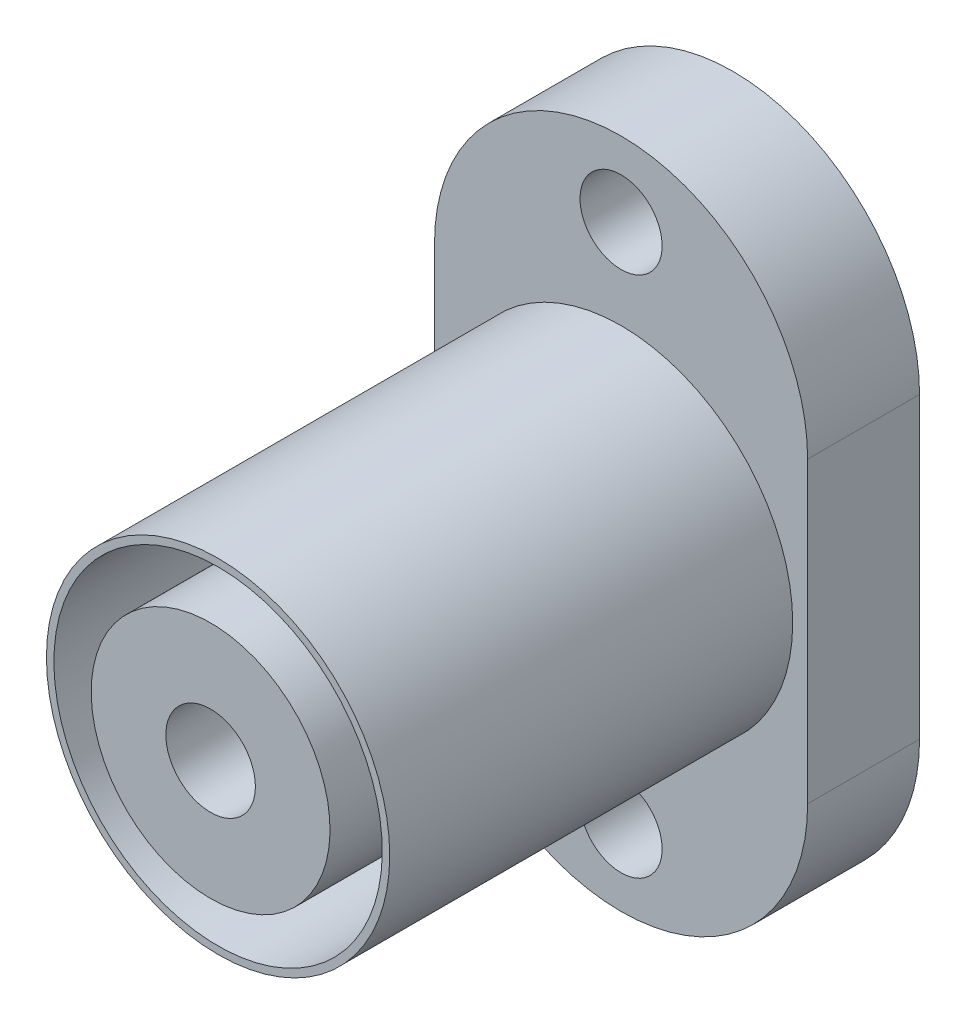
ISO-10303-21;
HEADER;
FILE_DESCRIPTION(('STEP AP214'),'2;1');
FILE_NAME('part.step','',(''),(''),'','','');
FILE_SCHEMA(('AUTOMOTIVE_DESIGN { 1 0 10303 214 1 1 1 1 }'));
ENDSEC;
DATA;
#1=APPLICATION_CONTEXT('core data for automotive mechanical design processes');
#2=APPLICATION_PROTOCOL_DEFINITION('international standard','automotive_design',2000,#1);
#3=PRODUCT_CONTEXT('',#1,'mechanical');
#4=PRODUCT('Part','Part','',(#3));
#5=PRODUCT_RELATED_PRODUCT_CATEGORY('part','',(#4));
#6=PRODUCT_DEFINITION_FORMATION('','',#4);
#7=PRODUCT_DEFINITION_CONTEXT('part definition',#1,'design');
#8=PRODUCT_DEFINITION('design','',#6,#7);
#9=PRODUCT_DEFINITION_SHAPE('','',#8);
#10=(LENGTH_UNIT() NAMED_UNIT(*) SI_UNIT(.MILLI.,.METRE.));
#11=(NAMED_UNIT(*) PLANE_ANGLE_UNIT() SI_UNIT($,.RADIAN.));
#12=(NAMED_UNIT(*) SI_UNIT($,.STERADIAN.) SOLID_ANGLE_UNIT());
#13=UNCERTAINTY_MEASURE_WITH_UNIT(LENGTH_MEASURE(1.E-05),#10,'distance_accuracy_value','');
#14=(GEOMETRIC_REPRESENTATION_CONTEXT(3) GLOBAL_UNCERTAINTY_ASSIGNED_CONTEXT((#13)) GLOBAL_UNIT_ASSIGNED_CONTEXT((#10,
#11,#12)) REPRESENTATION_CONTEXT('',''));
#15=CARTESIAN_POINT('',(0.,0.,0.));
#16=DIRECTION('',(0.,0.,1.));
#17=DIRECTION('',(1.,0.,0.));
#18=AXIS2_PLACEMENT_3D('',#15,#16,#17);
#19=CARTESIAN_POINT('',(-10.626,-10.626,38.));
#20=DIRECTION('',(0.,0.,-1.));
#21=DIRECTION('',(0.,1.,0.));
#22=AXIS2_PLACEMENT_3D('',#19,#20,#21);
#23=PLANE('',#22);
#24=CARTESIAN_POINT('',(0.,0.,38.));
#25=DIRECTION('',(0.,0.,-1.));
#26=DIRECTION('',(-1.,0.,0.));
#27=AXIS2_PLACEMENT_3D('',#24,#25,#26);
#28=CIRCLE('',#27,6.);
#29=CARTESIAN_POINT('',(-6.,0.,38.));
#30=VERTEX_POINT('',#29);
#31=EDGE_CURVE('E122',#30,#30,#28,.T.);
#32=ORIENTED_EDGE('',*,*,#31,.F.);
#33=EDGE_LOOP('',(#32));
#34=FACE_BOUND('',#33,.T.);
#35=CARTESIAN_POINT('',(0.,0.,38.));
#36=DIRECTION('',(0.,0.,-1.));
#37=DIRECTION('',(0.,1.,0.));
#38=AXIS2_PLACEMENT_3D('',#35,#36,#37);
#39=CIRCLE('',#38,10.5);
#40=CARTESIAN_POINT('',(0.,10.5,38.));
#41=VERTEX_POINT('',#40);
#42=EDGE_CURVE('E18',#41,#41,#39,.F.);
#43=ORIENTED_EDGE('',*,*,#42,.F.);
#44=EDGE_LOOP('',(#43));
#45=FACE_BOUND('',#44,.T.);
#46=ADVANCED_FACE('F14',(#34,#45),#23,.T.);
#47=CARTESIAN_POINT('',(0.,0.,38.));
#48=DIRECTION('',(0.,0.,-1.));
#49=DIRECTION('',(0.,1.,0.));
#50=AXIS2_PLACEMENT_3D('',#47,#48,#49);
#51=CYLINDRICAL_SURFACE('',#50,10.5);
#52=ORIENTED_EDGE('',*,*,#42,.T.);
#53=EDGE_LOOP('',(#52));
#54=FACE_BOUND('',#53,.T.);
#55=CARTESIAN_POINT('',(0.,0.,11.));
#56=DIRECTION('',(0.,0.,-1.));
#57=DIRECTION('',(0.,1.,0.));
#58=AXIS2_PLACEMENT_3D('',#55,#56,#57);
#59=CIRCLE('',#58,10.5);
#60=CARTESIAN_POINT('',(0.,10.5,11.));
#61=VERTEX_POINT('',#60);
#62=EDGE_CURVE('E117',#61,#61,#59,.F.);
#63=ORIENTED_EDGE('',*,*,#62,.F.);
#64=EDGE_LOOP('',(#63));
#65=FACE_BOUND('',#64,.T.);
#66=ADVANCED_FACE('F178',(#54,#65),#51,.F.);
#67=CARTESIAN_POINT('',(-13.156,-13.156,11.));
#68=DIRECTION('',(0.,0.,-1.));
#69=DIRECTION('',(0.,1.,0.));
#70=AXIS2_PLACEMENT_3D('',#67,#68,#69);
#71=PLANE('',#70);
#72=ORIENTED_EDGE('',*,*,#62,.T.);
#73=EDGE_LOOP('',(#72));
#74=FACE_BOUND('',#73,.T.);
#75=CARTESIAN_POINT('',(0.,0.,11.));
#76=DIRECTION('',(0.,0.,-1.));
#77=DIRECTION('',(0.,1.,0.));
#78=AXIS2_PLACEMENT_3D('',#75,#76,#77);
#79=CIRCLE('',#78,13.);
#80=CARTESIAN_POINT('',(0.,13.,11.));
#81=VERTEX_POINT('',#80);
#82=EDGE_CURVE('E115',#81,#81,#79,.F.);
#83=ORIENTED_EDGE('',*,*,#82,.F.);
#84=EDGE_LOOP('',(#83));
#85=FACE_BOUND('',#84,.T.);
#86=ADVANCED_FACE('F180',(#74,#85),#71,.T.);
#87=CARTESIAN_POINT('',(-16.192,16.192,70.));
#88=DIRECTION('',(0.,0.,1.));
#89=DIRECTION('',(0.,-1.,0.));
#90=AXIS2_PLACEMENT_3D('',#87,#88,#89);
#91=PLANE('',#90);
#92=CARTESIAN_POINT('',(0.,0.,70.));
#93=DIRECTION('',(0.,0.,1.));
#94=DIRECTION('',(1.,0.,0.));
#95=AXIS2_PLACEMENT_3D('',#92,#93,#94);
#96=CIRCLE('',#95,6.);
#97=CARTESIAN_POINT('',(6.,0.,70.));
#98=VERTEX_POINT('',#97);
#99=EDGE_CURVE('E126',#98,#98,#96,.T.);
#100=ORIENTED_EDGE('',*,*,#99,.F.);
#101=EDGE_LOOP('',(#100));
#102=FACE_BOUND('',#101,.T.);
#103=CARTESIAN_POINT('',(0.,0.,70.));
#104=DIRECTION('',(0.,0.,1.));
#105=DIRECTION('',(0.,-1.,0.));
#106=AXIS2_PLACEMENT_3D('',#103,#104,#105);
#107=CIRCLE('',#106,16.);
#108=CARTESIAN_POINT('',(0.,-16.,70.));
#109=VERTEX_POINT('',#108);
#110=EDGE_CURVE('E112',#109,#109,#107,.T.);
#111=ORIENTED_EDGE('',*,*,#110,.T.);
#112=EDGE_LOOP('',(#111));
#113=FACE_BOUND('',#112,.T.);
#114=ADVANCED_FACE('F183',(#102,#113),#91,.T.);
#115=CARTESIAN_POINT('',(0.,0.,11.));
#116=DIRECTION('',(0.,0.,-1.));
#117=DIRECTION('',(0.,1.,0.));
#118=AXIS2_PLACEMENT_3D('',#115,#116,#117);
#119=CYLINDRICAL_SURFACE('',#118,13.);
#120=ORIENTED_EDGE('',*,*,#82,.T.);
#121=EDGE_LOOP('',(#120));
#122=FACE_BOUND('',#121,.T.);
#123=CARTESIAN_POINT('',(0.,0.,0.));
#124=DIRECTION('',(0.,0.,-1.));
#125=DIRECTION('',(0.,1.,0.));
#126=AXIS2_PLACEMENT_3D('',#123,#124,#125);
#127=CIRCLE('',#126,13.);
#128=CARTESIAN_POINT('',(0.,13.,0.));
#129=VERTEX_POINT('',#128);
#130=EDGE_CURVE('E109',#129,#129,#127,.T.);
#131=ORIENTED_EDGE('',*,*,#130,.T.);
#132=EDGE_LOOP('',(#131));
#133=FACE_BOUND('',#132,.T.);
#134=ADVANCED_FACE('F186',(#122,#133),#119,.F.);
#135=CARTESIAN_POINT('',(0.,0.,20.));
#136=DIRECTION('',(0.,0.,1.));
#137=DIRECTION('',(0.,-1.,0.));
#138=AXIS2_PLACEMENT_3D('',#135,#136,#137);
#139=CYLINDRICAL_SURFACE('',#138,16.);
#140=ORIENTED_EDGE('',*,*,#110,.F.);
#141=EDGE_LOOP('',(#140));
#142=FACE_BOUND('',#141,.T.);
#143=CARTESIAN_POINT('',(0.,0.,20.));
#144=DIRECTION('',(0.,0.,1.));
#145=DIRECTION('',(0.,-1.,0.));
#146=AXIS2_PLACEMENT_3D('',#143,#144,#145);
#147=CIRCLE('',#146,16.);
#148=CARTESIAN_POINT('',(0.,-16.,20.));
#149=VERTEX_POINT('',#148);
#150=EDGE_CURVE('E65',#149,#149,#147,.T.);
#151=ORIENTED_EDGE('',*,*,#150,.T.);
#152=EDGE_LOOP('',(#151));
#153=FACE_BOUND('',#152,.T.);
#154=ADVANCED_FACE('F191',(#142,#153),#139,.T.);
#155=CARTESIAN_POINT('',(-25.,45.54,0.));
#156=DIRECTION('',(0.,0.,1.));
#157=DIRECTION('',(0.,-1.,0.));
#158=AXIS2_PLACEMENT_3D('',#155,#156,#157);
#159=PLANE('',#158);
#160=CARTESIAN_POINT('',(0.,35.,0.));
#161=DIRECTION('',(0.,0.,1.));
#162=DIRECTION('',(0.,-1.,0.));
#163=AXIS2_PLACEMENT_3D('',#160,#161,#162);
#164=CIRCLE('',#163,5.5);
#165=CARTESIAN_POINT('',(0.,29.5,0.));
#166=VERTEX_POINT('',#165);
#167=EDGE_CURVE('E99',#166,#166,#164,.F.);
#168=ORIENTED_EDGE('',*,*,#167,.F.);
#169=EDGE_LOOP('',(#168));
#170=FACE_BOUND('',#169,.T.);
#171=CARTESIAN_POINT('',(0.,-35.,0.));
#172=DIRECTION('',(0.,0.,1.));
#173=DIRECTION('',(0.,-1.,0.));
#174=AXIS2_PLACEMENT_3D('',#171,#172,#173);
#175=CIRCLE('',#174,5.5);
#176=CARTESIAN_POINT('',(0.,-40.5,0.));
#177=VERTEX_POINT('',#176);
#178=EDGE_CURVE('E102',#177,#177,#175,.F.);
#179=ORIENTED_EDGE('',*,*,#178,.F.);
#180=EDGE_LOOP('',(#179));
#181=FACE_BOUND('',#180,.T.);
#182=ORIENTED_EDGE('',*,*,#130,.F.);
#183=EDGE_LOOP('',(#182));
#184=FACE_BOUND('',#183,.T.);
#185=DIRECTION('',(0.,1.,0.));
#186=VECTOR('',#185,1.);
#187=CARTESIAN_POINT('',(25.,1.49999977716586E-09,0.));
#188=LINE('',#187,#186);
#189=CARTESIAN_POINT('',(25.,-19.9999999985,0.));
#190=VERTEX_POINT('',#189);
#191=CARTESIAN_POINT('',(25.,20.,0.));
#192=VERTEX_POINT('',#191);
#193=EDGE_CURVE('E61',#190,#192,#188,.T.);
#194=ORIENTED_EDGE('',*,*,#193,.F.);
#195=CARTESIAN_POINT('',(0.,-20.,0.));
#196=DIRECTION('',(0.,0.,1.));
#197=DIRECTION('',(0.,-1.,0.));
#198=AXIS2_PLACEMENT_3D('',#195,#196,#197);
#199=CIRCLE('',#198,25.);
#200=CARTESIAN_POINT('',(-25.,-19.9999999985,0.));
#201=VERTEX_POINT('',#200);
#202=EDGE_CURVE('E54',#190,#201,#199,.F.);
#203=ORIENTED_EDGE('',*,*,#202,.T.);
#204=DIRECTION('',(0.,-1.,0.));
#205=VECTOR('',#204,1.);
#206=CARTESIAN_POINT('',(-25.,3.99999998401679E-09,0.));
#207=LINE('',#206,#205);
#208=CARTESIAN_POINT('',(-25.,20.0000000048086,0.));
#209=VERTEX_POINT('',#208);
#210=EDGE_CURVE('E58',#209,#201,#207,.T.);
#211=ORIENTED_EDGE('',*,*,#210,.F.);
#212=CARTESIAN_POINT('',(0.,20.,0.));
#213=DIRECTION('',(0.,0.,1.));
#214=DIRECTION('',(0.,-1.,0.));
#215=AXIS2_PLACEMENT_3D('',#212,#213,#214);
#216=CIRCLE('',#215,25.);
#217=EDGE_CURVE('E73',#209,#192,#216,.F.);
#218=ORIENTED_EDGE('',*,*,#217,.T.);
#219=EDGE_LOOP('',(#194,#203,#211,#218));
#220=FACE_BOUND('',#219,.T.);
#221=ADVANCED_FACE('F56',(#170,#181,#184,#220),#159,.F.);
#222=CARTESIAN_POINT('',(-22.264,-22.264,20.));
#223=DIRECTION('',(0.,0.,-1.));
#224=DIRECTION('',(0.,1.,0.));
#225=AXIS2_PLACEMENT_3D('',#222,#223,#224);
#226=PLANE('',#225);
#227=ORIENTED_EDGE('',*,*,#150,.F.);
#228=EDGE_LOOP('',(#227));
#229=FACE_BOUND('',#228,.T.);
#230=CARTESIAN_POINT('',(0.,0.,20.));
#231=DIRECTION('',(0.,0.,-1.));
#232=DIRECTION('',(0.,1.,0.));
#233=AXIS2_PLACEMENT_3D('',#230,#231,#232);
#234=CIRCLE('',#233,22.);
#235=CARTESIAN_POINT('',(0.,22.,20.));
#236=VERTEX_POINT('',#235);
#237=EDGE_CURVE('E96',#236,#236,#234,.T.);
#238=ORIENTED_EDGE('',*,*,#237,.F.);
#239=EDGE_LOOP('',(#238));
#240=FACE_BOUND('',#239,.T.);
#241=ADVANCED_FACE('F190',(#229,#240),#226,.F.);
#242=CARTESIAN_POINT('',(0.,-20.,0.));
#243=DIRECTION('',(0.,0.,1.));
#244=DIRECTION('',(0.,-1.,0.));
#245=AXIS2_PLACEMENT_3D('',#242,#243,#244);
#246=CYLINDRICAL_SURFACE('',#245,25.);
#247=ORIENTED_EDGE('',*,*,#202,.F.);
#248=DIRECTION('',(0.,0.,-1.));
#249=VECTOR('',#248,1.);
#250=CARTESIAN_POINT('',(25.,-19.999999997,7.5));
#251=LINE('',#250,#249);
#252=CARTESIAN_POINT('',(25.,-19.9999999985,15.));
#253=VERTEX_POINT('',#252);
#254=EDGE_CURVE('E137',#253,#190,#251,.T.);
#255=ORIENTED_EDGE('',*,*,#254,.F.);
#256=CARTESIAN_POINT('',(0.,-20.,15.));
#257=DIRECTION('',(0.,0.,1.));
#258=DIRECTION('',(0.,-1.,0.));
#259=AXIS2_PLACEMENT_3D('',#256,#257,#258);
#260=CIRCLE('',#259,25.);
#261=CARTESIAN_POINT('',(-25.,-19.9999999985,15.));
#262=VERTEX_POINT('',#261);
#263=EDGE_CURVE('E70',#253,#262,#260,.F.);
#264=ORIENTED_EDGE('',*,*,#263,.T.);
#265=DIRECTION('',(0.,0.,1.));
#266=VECTOR('',#265,1.);
#267=CARTESIAN_POINT('',(-25.,-19.999999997,7.5));
#268=LINE('',#267,#266);
#269=EDGE_CURVE('E68',#201,#262,#268,.T.);
#270=ORIENTED_EDGE('',*,*,#269,.F.);
#271=EDGE_LOOP('',(#247,#255,#264,#270));
#272=FACE_BOUND('',#271,.T.);
#273=ADVANCED_FACE('F69',(#272),#246,.T.);
#274=CARTESIAN_POINT('',(-25.,20.000000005,0.));
#275=DIRECTION('',(-1.,0.,0.));
#276=DIRECTION('',(0.,-1.,0.));
#277=AXIS2_PLACEMENT_3D('',#274,#275,#276);
#278=PLANE('',#277);
#279=ORIENTED_EDGE('',*,*,#210,.T.);
#280=ORIENTED_EDGE('',*,*,#269,.T.);
#281=DIRECTION('',(0.,1.,0.));
#282=VECTOR('',#281,1.);
#283=CARTESIAN_POINT('',(-25.,0.,15.));
#284=LINE('',#283,#282);
#285=CARTESIAN_POINT('',(-25.,20.0000000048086,15.));
#286=VERTEX_POINT('',#285);
#287=EDGE_CURVE('E94',#262,#286,#284,.T.);
#288=ORIENTED_EDGE('',*,*,#287,.T.);
#289=DIRECTION('',(0.,0.,1.));
#290=VECTOR('',#289,1.);
#291=CARTESIAN_POINT('',(-25.,20.0000000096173,7.5));
#292=LINE('',#291,#290);
#293=EDGE_CURVE('E76',#286,#209,#292,.F.);
#294=ORIENTED_EDGE('',*,*,#293,.T.);
#295=EDGE_LOOP('',(#279,#280,#288,#294));
#296=FACE_BOUND('',#295,.T.);
#297=ADVANCED_FACE('F75',(#296),#278,.T.);
#298=CARTESIAN_POINT('',(0.,20.,0.));
#299=DIRECTION('',(0.,0.,1.));
#300=DIRECTION('',(0.,-1.,0.));
#301=AXIS2_PLACEMENT_3D('',#298,#299,#300);
#302=CYLINDRICAL_SURFACE('',#301,25.);
#303=CARTESIAN_POINT('',(0.,20.,15.));
#304=DIRECTION('',(0.,0.,1.));
#305=DIRECTION('',(0.,-1.,0.));
#306=AXIS2_PLACEMENT_3D('',#303,#304,#305);
#307=CIRCLE('',#306,25.);
#308=CARTESIAN_POINT('',(25.,20.,15.));
#309=VERTEX_POINT('',#308);
#310=EDGE_CURVE('E33',#286,#309,#307,.F.);
#311=ORIENTED_EDGE('',*,*,#310,.T.);
#312=DIRECTION('',(0.,0.,1.));
#313=VECTOR('',#312,1.);
#314=CARTESIAN_POINT('',(25.,20.,7.5));
#315=LINE('',#314,#313);
#316=EDGE_CURVE('E105',#192,#309,#315,.T.);
#317=ORIENTED_EDGE('',*,*,#316,.F.);
#318=ORIENTED_EDGE('',*,*,#217,.F.);
#319=ORIENTED_EDGE('',*,*,#293,.F.);
#320=EDGE_LOOP('',(#311,#317,#318,#319));
#321=FACE_BOUND('',#320,.T.);
#322=ADVANCED_FACE('F144',(#321),#302,.T.);
#323=CARTESIAN_POINT('',(25.,-19.999999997,0.));
#324=DIRECTION('',(1.,0.,0.));
#325=DIRECTION('',(0.,1.,0.));
#326=AXIS2_PLACEMENT_3D('',#323,#324,#325);
#327=PLANE('',#326);
#328=ORIENTED_EDGE('',*,*,#193,.T.);
#329=ORIENTED_EDGE('',*,*,#316,.T.);
#330=DIRECTION('',(0.,-1.,0.));
#331=VECTOR('',#330,1.);
#332=CARTESIAN_POINT('',(25.,0.,15.));
#333=LINE('',#332,#331);
#334=EDGE_CURVE('E92',#309,#253,#333,.T.);
#335=ORIENTED_EDGE('',*,*,#334,.T.);
#336=ORIENTED_EDGE('',*,*,#254,.T.);
#337=EDGE_LOOP('',(#328,#329,#335,#336));
#338=FACE_BOUND('',#337,.T.);
#339=ADVANCED_FACE('F140',(#338),#327,.T.);
#340=CARTESIAN_POINT('',(0.,-35.,0.));
#341=DIRECTION('',(0.,0.,1.));
#342=DIRECTION('',(0.,-1.,0.));
#343=AXIS2_PLACEMENT_3D('',#340,#341,#342);
#344=CYLINDRICAL_SURFACE('',#343,5.5);
#345=ORIENTED_EDGE('',*,*,#178,.T.);
#346=EDGE_LOOP('',(#345));
#347=FACE_BOUND('',#346,.T.);
#348=CARTESIAN_POINT('',(0.,-35.,15.));
#349=DIRECTION('',(0.,0.,1.));
#350=DIRECTION('',(0.,-1.,0.));
#351=AXIS2_PLACEMENT_3D('',#348,#349,#350);
#352=CIRCLE('',#351,5.5);
#353=CARTESIAN_POINT('',(0.,-40.5,15.));
#354=VERTEX_POINT('',#353);
#355=EDGE_CURVE('E89',#354,#354,#352,.T.);
#356=ORIENTED_EDGE('',*,*,#355,.T.);
#357=EDGE_LOOP('',(#356));
#358=FACE_BOUND('',#357,.T.);
#359=ADVANCED_FACE('F153',(#347,#358),#344,.F.);
#360=CARTESIAN_POINT('',(0.,35.,0.));
#361=DIRECTION('',(0.,0.,1.));
#362=DIRECTION('',(0.,-1.,0.));
#363=AXIS2_PLACEMENT_3D('',#360,#361,#362);
#364=CYLINDRICAL_SURFACE('',#363,5.5);
#365=ORIENTED_EDGE('',*,*,#167,.T.);
#366=EDGE_LOOP('',(#365));
#367=FACE_BOUND('',#366,.T.);
#368=CARTESIAN_POINT('',(0.,35.,15.));
#369=DIRECTION('',(0.,0.,1.));
#370=DIRECTION('',(0.,-1.,0.));
#371=AXIS2_PLACEMENT_3D('',#368,#369,#370);
#372=CIRCLE('',#371,5.5);
#373=CARTESIAN_POINT('',(0.,29.5,15.));
#374=VERTEX_POINT('',#373);
#375=EDGE_CURVE('E86',#374,#374,#372,.T.);
#376=ORIENTED_EDGE('',*,*,#375,.T.);
#377=EDGE_LOOP('',(#376));
#378=FACE_BOUND('',#377,.T.);
#379=ADVANCED_FACE('F201',(#367,#378),#364,.F.);
#380=CARTESIAN_POINT('',(0.,0.,69.));
#381=DIRECTION('',(0.,0.,-1.));
#382=DIRECTION('',(0.,1.,0.));
#383=AXIS2_PLACEMENT_3D('',#380,#381,#382);
#384=CYLINDRICAL_SURFACE('',#383,22.);
#385=ORIENTED_EDGE('',*,*,#237,.T.);
#386=EDGE_LOOP('',(#385));
#387=FACE_BOUND('',#386,.T.);
#388=CARTESIAN_POINT('',(0.,0.,69.));
#389=DIRECTION('',(0.,0.,-1.));
#390=DIRECTION('',(0.,1.,0.));
#391=AXIS2_PLACEMENT_3D('',#388,#389,#390);
#392=CIRCLE('',#391,22.);
#393=CARTESIAN_POINT('',(0.,22.,69.));
#394=VERTEX_POINT('',#393);
#395=EDGE_CURVE('E83',#394,#394,#392,.T.);
#396=ORIENTED_EDGE('',*,*,#395,.F.);
#397=EDGE_LOOP('',(#396));
#398=FACE_BOUND('',#397,.T.);
#399=ADVANCED_FACE('F174',(#387,#398),#384,.F.);
#400=CARTESIAN_POINT('',(-25.,-45.54,15.));
#401=DIRECTION('',(0.,0.,-1.));
#402=DIRECTION('',(0.,1.,0.));
#403=AXIS2_PLACEMENT_3D('',#400,#401,#402);
#404=PLANE('',#403);
#405=ORIENTED_EDGE('',*,*,#375,.F.);
#406=EDGE_LOOP('',(#405));
#407=FACE_BOUND('',#406,.T.);
#408=ORIENTED_EDGE('',*,*,#355,.F.);
#409=EDGE_LOOP('',(#408));
#410=FACE_BOUND('',#409,.T.);
#411=CARTESIAN_POINT('',(0.,0.,15.));
#412=DIRECTION('',(0.,0.,-1.));
#413=DIRECTION('',(0.,1.,0.));
#414=AXIS2_PLACEMENT_3D('',#411,#412,#413);
#415=CIRCLE('',#414,23.);
#416=CARTESIAN_POINT('',(0.,23.,15.));
#417=VERTEX_POINT('',#416);
#418=EDGE_CURVE('E24',#417,#417,#415,.T.);
#419=ORIENTED_EDGE('',*,*,#418,.T.);
#420=EDGE_LOOP('',(#419));
#421=FACE_BOUND('',#420,.T.);
#422=ORIENTED_EDGE('',*,*,#310,.F.);
#423=ORIENTED_EDGE('',*,*,#287,.F.);
#424=ORIENTED_EDGE('',*,*,#263,.F.);
#425=ORIENTED_EDGE('',*,*,#334,.F.);
#426=EDGE_LOOP('',(#422,#423,#424,#425));
#427=FACE_BOUND('',#426,.T.);
#428=ADVANCED_FACE('F143',(#407,#410,#421,#427),#404,.F.);
#429=CARTESIAN_POINT('',(23.276,23.276,69.));
#430=DIRECTION('',(0.,0.,1.));
#431=DIRECTION('',(-1.,0.,0.));
#432=AXIS2_PLACEMENT_3D('',#429,#430,#431);
#433=PLANE('',#432);
#434=ORIENTED_EDGE('',*,*,#395,.T.);
#435=EDGE_LOOP('',(#434));
#436=FACE_BOUND('',#435,.T.);
#437=CARTESIAN_POINT('',(0.,0.,69.));
#438=DIRECTION('',(0.,0.,-1.));
#439=DIRECTION('',(0.,1.,0.));
#440=AXIS2_PLACEMENT_3D('',#437,#438,#439);
#441=CIRCLE('',#440,23.);
#442=CARTESIAN_POINT('',(0.,23.,69.));
#443=VERTEX_POINT('',#442);
#444=EDGE_CURVE('E9',#443,#443,#441,.F.);
#445=ORIENTED_EDGE('',*,*,#444,.T.);
#446=EDGE_LOOP('',(#445));
#447=FACE_BOUND('',#446,.T.);
#448=ADVANCED_FACE('F16',(#436,#447),#433,.T.);
#449=CARTESIAN_POINT('',(0.,0.,69.));
#450=DIRECTION('',(0.,0.,-1.));
#451=DIRECTION('',(0.,1.,0.));
#452=AXIS2_PLACEMENT_3D('',#449,#450,#451);
#453=CYLINDRICAL_SURFACE('',#452,23.);
#454=ORIENTED_EDGE('',*,*,#418,.F.);
#455=EDGE_LOOP('',(#454));
#456=FACE_BOUND('',#455,.T.);
#457=ORIENTED_EDGE('',*,*,#444,.F.);
#458=EDGE_LOOP('',(#457));
#459=FACE_BOUND('',#458,.T.);
#460=ADVANCED_FACE('F158',(#456,#459),#453,.T.);
#461=CARTESIAN_POINT('',(0.,0.,0.));
#462=DIRECTION('',(0.,0.,1.));
#463=DIRECTION('',(1.,0.,0.));
#464=AXIS2_PLACEMENT_3D('',#461,#462,#463);
#465=CYLINDRICAL_SURFACE('',#464,6.);
#466=ORIENTED_EDGE('',*,*,#31,.T.);
#467=EDGE_LOOP('',(#466));
#468=FACE_BOUND('',#467,.T.);
#469=ORIENTED_EDGE('',*,*,#99,.T.);
#470=EDGE_LOOP('',(#469));
#471=FACE_BOUND('',#470,.T.);
#472=ADVANCED_FACE('F160',(#468,#471),#465,.F.);
#473=CLOSED_SHELL('',(#46,#66,#86,#114,#134,#154,#221,#241,#273,#297,#322,#339,#359,#379,#399,
#428,#448,#460,#472));
#474=MANIFOLD_SOLID_BREP('B1',#473);
#475=ADVANCED_BREP_SHAPE_REPRESENTATION('',(#18,#474),#14);
#476=SHAPE_DEFINITION_REPRESENTATION(#9,#475);
ENDSEC;
END-ISO-10303-21;
